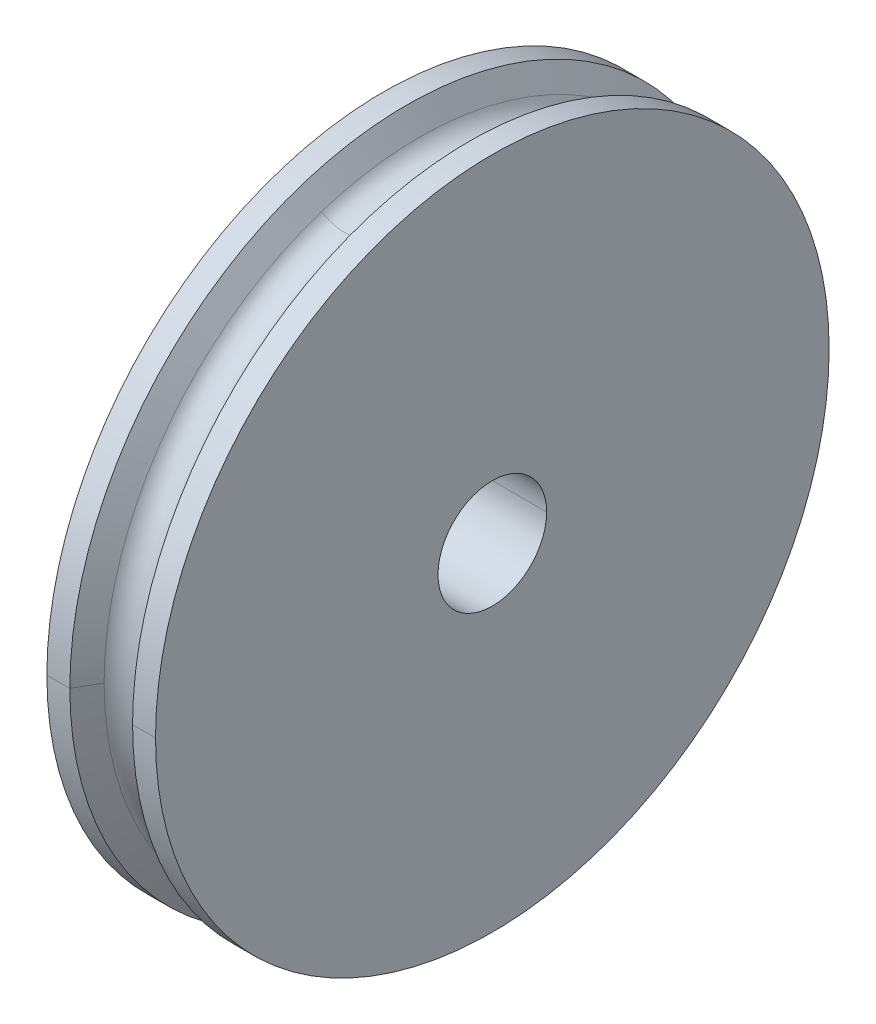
ISO-10303-21;
HEADER;
FILE_DESCRIPTION(('STEP AP214'),'2;1');
FILE_NAME('part.step','',(''),(''),'','','');
FILE_SCHEMA(('AUTOMOTIVE_DESIGN { 1 0 10303 214 1 1 1 1 }'));
ENDSEC;
DATA;
#1=APPLICATION_CONTEXT('core data for automotive mechanical design processes');
#2=APPLICATION_PROTOCOL_DEFINITION('international standard','automotive_design',2000,#1);
#3=PRODUCT_CONTEXT('',#1,'mechanical');
#4=PRODUCT('Part','Part','',(#3));
#5=PRODUCT_RELATED_PRODUCT_CATEGORY('part','',(#4));
#6=PRODUCT_DEFINITION_FORMATION('','',#4);
#7=PRODUCT_DEFINITION_CONTEXT('part definition',#1,'design');
#8=PRODUCT_DEFINITION('design','',#6,#7);
#9=PRODUCT_DEFINITION_SHAPE('','',#8);
#10=(LENGTH_UNIT() NAMED_UNIT(*) SI_UNIT(.MILLI.,.METRE.));
#11=(NAMED_UNIT(*) PLANE_ANGLE_UNIT() SI_UNIT($,.RADIAN.));
#12=(NAMED_UNIT(*) SI_UNIT($,.STERADIAN.) SOLID_ANGLE_UNIT());
#13=UNCERTAINTY_MEASURE_WITH_UNIT(LENGTH_MEASURE(1.E-05),#10,'distance_accuracy_value','');
#14=(GEOMETRIC_REPRESENTATION_CONTEXT(3) GLOBAL_UNCERTAINTY_ASSIGNED_CONTEXT((#13)) GLOBAL_UNIT_ASSIGNED_CONTEXT((#10,
#11,#12)) REPRESENTATION_CONTEXT('',''));
#15=CARTESIAN_POINT('',(0.,0.,0.));
#16=DIRECTION('',(0.,0.,1.));
#17=DIRECTION('',(1.,0.,0.));
#18=AXIS2_PLACEMENT_3D('',#15,#16,#17);
#19=CARTESIAN_POINT('',(-5.,31.,0.));
#20=DIRECTION('',(-1.,0.,0.));
#21=DIRECTION('',(0.,0.,1.));
#22=AXIS2_PLACEMENT_3D('',#19,#20,#21);
#23=PLANE('',#22);
#24=CARTESIAN_POINT('',(-5.,0.,0.));
#25=DIRECTION('',(1.,0.,0.));
#26=DIRECTION('',(0.,0.,-1.));
#27=AXIS2_PLACEMENT_3D('',#24,#25,#26);
#28=CIRCLE('',#27,5.);
#29=CARTESIAN_POINT('',(-5.,0.,-5.));
#30=VERTEX_POINT('',#29);
#31=CARTESIAN_POINT('',(-5.,0.,5.));
#32=VERTEX_POINT('',#31);
#33=EDGE_CURVE('E11',#30,#32,#28,.T.);
#34=ORIENTED_EDGE('',*,*,#33,.T.);
#35=CARTESIAN_POINT('',(-5.,0.,0.));
#36=DIRECTION('',(1.,0.,0.));
#37=DIRECTION('',(0.,0.,-1.));
#38=AXIS2_PLACEMENT_3D('',#35,#36,#37);
#39=CIRCLE('',#38,5.);
#40=EDGE_CURVE('E25',#32,#30,#39,.T.);
#41=ORIENTED_EDGE('',*,*,#40,.T.);
#42=EDGE_LOOP('',(#34,#41));
#43=FACE_BOUND('',#42,.T.);
#44=CARTESIAN_POINT('',(-5.,0.,0.));
#45=DIRECTION('',(1.,0.,0.));
#46=DIRECTION('',(0.,0.,-1.));
#47=AXIS2_PLACEMENT_3D('',#44,#45,#46);
#48=CIRCLE('',#47,31.);
#49=CARTESIAN_POINT('',(-5.,0.,31.));
#50=VERTEX_POINT('',#49);
#51=CARTESIAN_POINT('',(-5.,0.,-31.));
#52=VERTEX_POINT('',#51);
#53=EDGE_CURVE('E219',#50,#52,#48,.T.);
#54=ORIENTED_EDGE('',*,*,#53,.F.);
#55=CARTESIAN_POINT('',(-5.,0.,0.));
#56=DIRECTION('',(1.,0.,0.));
#57=DIRECTION('',(0.,0.,-1.));
#58=AXIS2_PLACEMENT_3D('',#55,#56,#57);
#59=CIRCLE('',#58,31.);
#60=EDGE_CURVE('E214',#52,#50,#59,.T.);
#61=ORIENTED_EDGE('',*,*,#60,.F.);
#62=EDGE_LOOP('',(#54,#61));
#63=FACE_BOUND('',#62,.T.);
#64=ADVANCED_FACE('F17',(#43,#63),#23,.T.);
#65=CARTESIAN_POINT('',(5.,0.,0.));
#66=DIRECTION('',(1.,0.,0.));
#67=DIRECTION('',(0.,-1.,0.));
#68=AXIS2_PLACEMENT_3D('',#65,#66,#67);
#69=CYLINDRICAL_SURFACE('',#68,31.);
#70=DIRECTION('',(1.,0.,0.));
#71=VECTOR('',#70,1.);
#72=CARTESIAN_POINT('',(-5.,0.,31.));
#73=LINE('',#72,#71);
#74=CARTESIAN_POINT('',(-2.8867513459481,0.,31.));
#75=VERTEX_POINT('',#74);
#76=EDGE_CURVE('E210',#50,#75,#73,.T.);
#77=ORIENTED_EDGE('',*,*,#76,.T.);
#78=CARTESIAN_POINT('',(-2.8867513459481,0.,0.));
#79=DIRECTION('',(1.,0.,0.));
#80=DIRECTION('',(0.,0.,-1.));
#81=AXIS2_PLACEMENT_3D('',#78,#79,#80);
#82=CIRCLE('',#81,31.);
#83=CARTESIAN_POINT('',(-2.8867513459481,0.,-31.));
#84=VERTEX_POINT('',#83);
#85=EDGE_CURVE('E205',#84,#75,#82,.T.);
#86=ORIENTED_EDGE('',*,*,#85,.F.);
#87=DIRECTION('',(1.,0.,0.));
#88=VECTOR('',#87,1.);
#89=CARTESIAN_POINT('',(-5.,0.,-31.));
#90=LINE('',#89,#88);
#91=EDGE_CURVE('E200',#52,#84,#90,.T.);
#92=ORIENTED_EDGE('',*,*,#91,.F.);
#93=ORIENTED_EDGE('',*,*,#60,.T.);
#94=EDGE_LOOP('',(#77,#86,#92,#93));
#95=FACE_BOUND('',#94,.T.);
#96=ADVANCED_FACE('F235',(#95),#69,.T.);
#97=CARTESIAN_POINT('',(5.,0.,0.));
#98=DIRECTION('',(1.,0.,0.));
#99=DIRECTION('',(0.,1.,0.));
#100=AXIS2_PLACEMENT_3D('',#97,#98,#99);
#101=CYLINDRICAL_SURFACE('',#100,31.);
#102=ORIENTED_EDGE('',*,*,#76,.F.);
#103=ORIENTED_EDGE('',*,*,#53,.T.);
#104=ORIENTED_EDGE('',*,*,#91,.T.);
#105=CARTESIAN_POINT('',(-2.8867513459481,0.,0.));
#106=DIRECTION('',(1.,0.,0.));
#107=DIRECTION('',(0.,0.,-1.));
#108=AXIS2_PLACEMENT_3D('',#105,#106,#107);
#109=CIRCLE('',#108,31.);
#110=EDGE_CURVE('E195',#75,#84,#109,.T.);
#111=ORIENTED_EDGE('',*,*,#110,.F.);
#112=EDGE_LOOP('',(#102,#103,#104,#111));
#113=FACE_BOUND('',#112,.T.);
#114=ADVANCED_FACE('F230',(#113),#101,.T.);
#115=CARTESIAN_POINT('',(-1.7320508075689,0.,0.));
#116=DIRECTION('',(-1.,0.,0.));
#117=DIRECTION('',(0.,1.,0.));
#118=AXIS2_PLACEMENT_3D('',#115,#116,#117);
#119=CONICAL_SURFACE('',#118,29.,1.04719755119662);
#120=DIRECTION('',(-0.499999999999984,0.,-0.866025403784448));
#121=VECTOR('',#120,1.);
#122=CARTESIAN_POINT('',(-1.7320508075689,0.,-29.));
#123=LINE('',#122,#121);
#124=CARTESIAN_POINT('',(-1.7320508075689,0.,-29.));
#125=VERTEX_POINT('',#124);
#126=EDGE_CURVE('E190',#125,#84,#123,.T.);
#127=ORIENTED_EDGE('',*,*,#126,.F.);
#128=CARTESIAN_POINT('',(-1.7320508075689,0.,0.));
#129=DIRECTION('',(1.,0.,0.));
#130=DIRECTION('',(0.,0.,-1.));
#131=AXIS2_PLACEMENT_3D('',#128,#129,#130);
#132=CIRCLE('',#131,29.);
#133=CARTESIAN_POINT('',(-1.73205080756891,-27.5806389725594,-8.96149283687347));
#134=VERTEX_POINT('',#133);
#135=EDGE_CURVE('E185',#134,#125,#132,.T.);
#136=ORIENTED_EDGE('',*,*,#135,.F.);
#137=CARTESIAN_POINT('',(-1.7320508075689,0.,0.));
#138=DIRECTION('',(1.,0.,0.));
#139=DIRECTION('',(0.,0.,-1.));
#140=AXIS2_PLACEMENT_3D('',#137,#138,#139);
#141=CIRCLE('',#140,29.);
#142=CARTESIAN_POINT('',(-1.7320508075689,0.,29.));
#143=VERTEX_POINT('',#142);
#144=EDGE_CURVE('E180',#143,#134,#141,.T.);
#145=ORIENTED_EDGE('',*,*,#144,.F.);
#146=DIRECTION('',(-0.499999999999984,0.,0.866025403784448));
#147=VECTOR('',#146,1.);
#148=CARTESIAN_POINT('',(-1.7320508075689,0.,29.));
#149=LINE('',#148,#147);
#150=EDGE_CURVE('E175',#143,#75,#149,.T.);
#151=ORIENTED_EDGE('',*,*,#150,.T.);
#152=ORIENTED_EDGE('',*,*,#110,.T.);
#153=EDGE_LOOP('',(#127,#136,#145,#151,#152));
#154=FACE_BOUND('',#153,.T.);
#155=ADVANCED_FACE('F241',(#154),#119,.T.);
#156=CARTESIAN_POINT('',(-1.7320508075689,0.,0.));
#157=DIRECTION('',(-1.,0.,0.));
#158=DIRECTION('',(0.,-1.,0.));
#159=AXIS2_PLACEMENT_3D('',#156,#157,#158);
#160=CONICAL_SURFACE('',#159,29.,1.04719755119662);
#161=ORIENTED_EDGE('',*,*,#126,.T.);
#162=ORIENTED_EDGE('',*,*,#85,.T.);
#163=ORIENTED_EDGE('',*,*,#150,.F.);
#164=CARTESIAN_POINT('',(-1.7320508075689,0.,0.));
#165=DIRECTION('',(1.,0.,0.));
#166=DIRECTION('',(0.,0.,-1.));
#167=AXIS2_PLACEMENT_3D('',#164,#165,#166);
#168=CIRCLE('',#167,29.);
#169=CARTESIAN_POINT('',(-1.73205080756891,27.5806389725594,8.96149283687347));
#170=VERTEX_POINT('',#169);
#171=EDGE_CURVE('E170',#170,#143,#168,.T.);
#172=ORIENTED_EDGE('',*,*,#171,.F.);
#173=CARTESIAN_POINT('',(-1.7320508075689,0.,0.));
#174=DIRECTION('',(1.,0.,0.));
#175=DIRECTION('',(0.,0.,-1.));
#176=AXIS2_PLACEMENT_3D('',#173,#174,#175);
#177=CIRCLE('',#176,29.);
#178=EDGE_CURVE('E165',#125,#170,#177,.T.);
#179=ORIENTED_EDGE('',*,*,#178,.F.);
#180=EDGE_LOOP('',(#161,#162,#163,#172,#179));
#181=FACE_BOUND('',#180,.T.);
#182=ADVANCED_FACE('F238',(#181),#160,.T.);
#183=CARTESIAN_POINT('',(0.,0.,0.));
#184=DIRECTION('',(1.,0.,0.));
#185=DIRECTION('',(0.,-0.309016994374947,0.951056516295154));
#186=AXIS2_PLACEMENT_3D('',#183,#184,#185);
#187=TOROIDAL_SURFACE('',#186,30.,2.00000000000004);
#188=CARTESIAN_POINT('',(0.,-28.5316954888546,-9.27050983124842));
#189=DIRECTION('',(0.,0.309016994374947,-0.951056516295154));
#190=DIRECTION('',(-0.86602540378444,0.475528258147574,0.154508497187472));
#191=AXIS2_PLACEMENT_3D('',#188,#189,#190);
#192=CIRCLE('',#191,2.00000000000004);
#193=CARTESIAN_POINT('',(1.73205080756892,-27.5806389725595,-8.96149283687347));
#194=VERTEX_POINT('',#193);
#195=EDGE_CURVE('E160',#134,#194,#192,.T.);
#196=ORIENTED_EDGE('',*,*,#195,.F.);
#197=ORIENTED_EDGE('',*,*,#135,.T.);
#198=ORIENTED_EDGE('',*,*,#178,.T.);
#199=CARTESIAN_POINT('',(0.,28.5316954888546,9.27050983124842));
#200=DIRECTION('',(0.,-0.309016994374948,0.951056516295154));
#201=DIRECTION('',(-0.866025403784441,-0.475528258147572,-0.154508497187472));
#202=AXIS2_PLACEMENT_3D('',#199,#200,#201);
#203=CIRCLE('',#202,2.00000000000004);
#204=CARTESIAN_POINT('',(1.73205080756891,27.5806389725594,8.96149283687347));
#205=VERTEX_POINT('',#204);
#206=EDGE_CURVE('E156',#170,#205,#203,.T.);
#207=ORIENTED_EDGE('',*,*,#206,.T.);
#208=CARTESIAN_POINT('',(1.7320508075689,0.,0.));
#209=DIRECTION('',(1.,0.,0.));
#210=DIRECTION('',(0.,0.,-1.));
#211=AXIS2_PLACEMENT_3D('',#208,#209,#210);
#212=CIRCLE('',#211,29.);
#213=CARTESIAN_POINT('',(1.7320508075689,0.,-29.));
#214=VERTEX_POINT('',#213);
#215=EDGE_CURVE('E151',#214,#205,#212,.T.);
#216=ORIENTED_EDGE('',*,*,#215,.F.);
#217=CARTESIAN_POINT('',(1.7320508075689,0.,0.));
#218=DIRECTION('',(1.,0.,0.));
#219=DIRECTION('',(0.,0.,-1.));
#220=AXIS2_PLACEMENT_3D('',#217,#218,#219);
#221=CIRCLE('',#220,29.);
#222=EDGE_CURVE('E146',#194,#214,#221,.T.);
#223=ORIENTED_EDGE('',*,*,#222,.F.);
#224=EDGE_LOOP('',(#196,#197,#198,#207,#216,#223));
#225=FACE_BOUND('',#224,.T.);
#226=ADVANCED_FACE('F251',(#225),#187,.F.);
#227=CARTESIAN_POINT('',(2.8867513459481,0.,0.));
#228=DIRECTION('',(1.,0.,0.));
#229=DIRECTION('',(0.,1.,0.));
#230=AXIS2_PLACEMENT_3D('',#227,#228,#229);
#231=CONICAL_SURFACE('',#230,31.,1.04719755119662);
#232=DIRECTION('',(0.499999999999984,0.,0.866025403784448));
#233=VECTOR('',#232,1.);
#234=CARTESIAN_POINT('',(1.7320508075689,0.,29.));
#235=LINE('',#234,#233);
#236=CARTESIAN_POINT('',(1.7320508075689,0.,29.));
#237=VERTEX_POINT('',#236);
#238=CARTESIAN_POINT('',(2.8867513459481,0.,31.));
#239=VERTEX_POINT('',#238);
#240=EDGE_CURVE('E141',#237,#239,#235,.T.);
#241=ORIENTED_EDGE('',*,*,#240,.F.);
#242=CARTESIAN_POINT('',(1.7320508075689,0.,0.));
#243=DIRECTION('',(1.,0.,0.));
#244=DIRECTION('',(0.,0.,-1.));
#245=AXIS2_PLACEMENT_3D('',#242,#243,#244);
#246=CIRCLE('',#245,29.);
#247=EDGE_CURVE('E136',#237,#194,#246,.T.);
#248=ORIENTED_EDGE('',*,*,#247,.T.);
#249=ORIENTED_EDGE('',*,*,#222,.T.);
#250=DIRECTION('',(0.499999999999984,0.,-0.866025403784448));
#251=VECTOR('',#250,1.);
#252=CARTESIAN_POINT('',(1.7320508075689,0.,-29.));
#253=LINE('',#252,#251);
#254=CARTESIAN_POINT('',(2.8867513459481,0.,-31.));
#255=VERTEX_POINT('',#254);
#256=EDGE_CURVE('E132',#214,#255,#253,.T.);
#257=ORIENTED_EDGE('',*,*,#256,.T.);
#258=CARTESIAN_POINT('',(2.8867513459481,0.,0.));
#259=DIRECTION('',(1.,0.,0.));
#260=DIRECTION('',(0.,0.,-1.));
#261=AXIS2_PLACEMENT_3D('',#258,#259,#260);
#262=CIRCLE('',#261,31.);
#263=EDGE_CURVE('E127',#239,#255,#262,.T.);
#264=ORIENTED_EDGE('',*,*,#263,.F.);
#265=EDGE_LOOP('',(#241,#248,#249,#257,#264));
#266=FACE_BOUND('',#265,.T.);
#267=ADVANCED_FACE('F253',(#266),#231,.T.);
#268=CARTESIAN_POINT('',(5.,0.,0.));
#269=DIRECTION('',(1.,0.,0.));
#270=DIRECTION('',(0.,1.,0.));
#271=AXIS2_PLACEMENT_3D('',#268,#269,#270);
#272=CYLINDRICAL_SURFACE('',#271,31.);
#273=DIRECTION('',(1.,0.,0.));
#274=VECTOR('',#273,1.);
#275=CARTESIAN_POINT('',(2.8867513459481,0.,31.));
#276=LINE('',#275,#274);
#277=CARTESIAN_POINT('',(5.,0.,31.));
#278=VERTEX_POINT('',#277);
#279=EDGE_CURVE('E122',#239,#278,#276,.T.);
#280=ORIENTED_EDGE('',*,*,#279,.F.);
#281=ORIENTED_EDGE('',*,*,#263,.T.);
#282=DIRECTION('',(1.,0.,0.));
#283=VECTOR('',#282,1.);
#284=CARTESIAN_POINT('',(2.8867513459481,0.,-31.));
#285=LINE('',#284,#283);
#286=CARTESIAN_POINT('',(5.,0.,-31.));
#287=VERTEX_POINT('',#286);
#288=EDGE_CURVE('E118',#255,#287,#285,.T.);
#289=ORIENTED_EDGE('',*,*,#288,.T.);
#290=CARTESIAN_POINT('',(5.,0.,0.));
#291=DIRECTION('',(1.,0.,0.));
#292=DIRECTION('',(0.,0.,-1.));
#293=AXIS2_PLACEMENT_3D('',#290,#291,#292);
#294=CIRCLE('',#293,31.);
#295=EDGE_CURVE('E107',#278,#287,#294,.T.);
#296=ORIENTED_EDGE('',*,*,#295,.F.);
#297=EDGE_LOOP('',(#280,#281,#289,#296));
#298=FACE_BOUND('',#297,.T.);
#299=ADVANCED_FACE('F276',(#298),#272,.T.);
#300=CARTESIAN_POINT('',(5.,5.,0.));
#301=DIRECTION('',(1.,0.,0.));
#302=DIRECTION('',(0.,0.,-1.));
#303=AXIS2_PLACEMENT_3D('',#300,#301,#302);
#304=PLANE('',#303);
#305=CARTESIAN_POINT('',(5.,0.,0.));
#306=DIRECTION('',(1.,0.,0.));
#307=DIRECTION('',(0.,0.,-1.));
#308=AXIS2_PLACEMENT_3D('',#305,#306,#307);
#309=CIRCLE('',#308,31.);
#310=EDGE_CURVE('E104',#287,#278,#309,.T.);
#311=ORIENTED_EDGE('',*,*,#310,.T.);
#312=ORIENTED_EDGE('',*,*,#295,.T.);
#313=EDGE_LOOP('',(#311,#312));
#314=FACE_BOUND('',#313,.T.);
#315=CARTESIAN_POINT('',(5.,0.,0.));
#316=DIRECTION('',(1.,0.,0.));
#317=DIRECTION('',(0.,0.,-1.));
#318=AXIS2_PLACEMENT_3D('',#315,#316,#317);
#319=CIRCLE('',#318,5.);
#320=CARTESIAN_POINT('',(5.,0.,5.));
#321=VERTEX_POINT('',#320);
#322=CARTESIAN_POINT('',(5.,0.,-5.));
#323=VERTEX_POINT('',#322);
#324=EDGE_CURVE('E91',#321,#323,#319,.T.);
#325=ORIENTED_EDGE('',*,*,#324,.F.);
#326=CARTESIAN_POINT('',(5.,0.,0.));
#327=DIRECTION('',(1.,0.,0.));
#328=DIRECTION('',(0.,0.,-1.));
#329=AXIS2_PLACEMENT_3D('',#326,#327,#328);
#330=CIRCLE('',#329,5.);
#331=EDGE_CURVE('E87',#323,#321,#330,.T.);
#332=ORIENTED_EDGE('',*,*,#331,.F.);
#333=EDGE_LOOP('',(#325,#332));
#334=FACE_BOUND('',#333,.T.);
#335=ADVANCED_FACE('F89',(#314,#334),#304,.T.);
#336=CARTESIAN_POINT('',(5.,0.,0.));
#337=DIRECTION('',(1.,0.,0.));
#338=DIRECTION('',(0.,-1.,0.));
#339=AXIS2_PLACEMENT_3D('',#336,#337,#338);
#340=CYLINDRICAL_SURFACE('',#339,5.);
#341=DIRECTION('',(1.,0.,0.));
#342=VECTOR('',#341,1.);
#343=CARTESIAN_POINT('',(-5.,0.,5.));
#344=LINE('',#343,#342);
#345=EDGE_CURVE('E95',#32,#321,#344,.T.);
#346=ORIENTED_EDGE('',*,*,#345,.F.);
#347=ORIENTED_EDGE('',*,*,#33,.F.);
#348=DIRECTION('',(1.,0.,0.));
#349=VECTOR('',#348,1.);
#350=CARTESIAN_POINT('',(-5.,0.,-5.));
#351=LINE('',#350,#349);
#352=EDGE_CURVE('E98',#30,#323,#351,.T.);
#353=ORIENTED_EDGE('',*,*,#352,.T.);
#354=ORIENTED_EDGE('',*,*,#331,.T.);
#355=EDGE_LOOP('',(#346,#347,#353,#354));
#356=FACE_BOUND('',#355,.T.);
#357=ADVANCED_FACE('F99',(#356),#340,.F.);
#358=CARTESIAN_POINT('',(5.,0.,0.));
#359=DIRECTION('',(1.,0.,0.));
#360=DIRECTION('',(0.,1.,0.));
#361=AXIS2_PLACEMENT_3D('',#358,#359,#360);
#362=CYLINDRICAL_SURFACE('',#361,5.);
#363=ORIENTED_EDGE('',*,*,#345,.T.);
#364=ORIENTED_EDGE('',*,*,#324,.T.);
#365=ORIENTED_EDGE('',*,*,#352,.F.);
#366=ORIENTED_EDGE('',*,*,#40,.F.);
#367=EDGE_LOOP('',(#363,#364,#365,#366));
#368=FACE_BOUND('',#367,.T.);
#369=ADVANCED_FACE('F103',(#368),#362,.F.);
#370=CARTESIAN_POINT('',(5.,0.,0.));
#371=DIRECTION('',(1.,0.,0.));
#372=DIRECTION('',(0.,-1.,0.));
#373=AXIS2_PLACEMENT_3D('',#370,#371,#372);
#374=CYLINDRICAL_SURFACE('',#373,31.);
#375=ORIENTED_EDGE('',*,*,#279,.T.);
#376=ORIENTED_EDGE('',*,*,#310,.F.);
#377=ORIENTED_EDGE('',*,*,#288,.F.);
#378=CARTESIAN_POINT('',(2.8867513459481,0.,0.));
#379=DIRECTION('',(1.,0.,0.));
#380=DIRECTION('',(0.,0.,-1.));
#381=AXIS2_PLACEMENT_3D('',#378,#379,#380);
#382=CIRCLE('',#381,31.);
#383=EDGE_CURVE('E101',#255,#239,#382,.T.);
#384=ORIENTED_EDGE('',*,*,#383,.T.);
#385=EDGE_LOOP('',(#375,#376,#377,#384));
#386=FACE_BOUND('',#385,.T.);
#387=ADVANCED_FACE('F273',(#386),#374,.T.);
#388=CARTESIAN_POINT('',(2.8867513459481,0.,0.));
#389=DIRECTION('',(1.,0.,0.));
#390=DIRECTION('',(0.,-1.,0.));
#391=AXIS2_PLACEMENT_3D('',#388,#389,#390);
#392=CONICAL_SURFACE('',#391,31.,1.04719755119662);
#393=ORIENTED_EDGE('',*,*,#240,.T.);
#394=ORIENTED_EDGE('',*,*,#383,.F.);
#395=ORIENTED_EDGE('',*,*,#256,.F.);
#396=ORIENTED_EDGE('',*,*,#215,.T.);
#397=CARTESIAN_POINT('',(1.7320508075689,0.,0.));
#398=DIRECTION('',(1.,0.,0.));
#399=DIRECTION('',(0.,0.,-1.));
#400=AXIS2_PLACEMENT_3D('',#397,#398,#399);
#401=CIRCLE('',#400,29.);
#402=EDGE_CURVE('E249',#205,#237,#401,.T.);
#403=ORIENTED_EDGE('',*,*,#402,.T.);
#404=EDGE_LOOP('',(#393,#394,#395,#396,#403));
#405=FACE_BOUND('',#404,.T.);
#406=ADVANCED_FACE('F257',(#405),#392,.T.);
#407=CARTESIAN_POINT('',(0.,0.,0.));
#408=DIRECTION('',(1.,0.,0.));
#409=DIRECTION('',(0.,0.309016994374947,-0.951056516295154));
#410=AXIS2_PLACEMENT_3D('',#407,#408,#409);
#411=TOROIDAL_SURFACE('',#410,30.,2.00000000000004);
#412=ORIENTED_EDGE('',*,*,#195,.T.);
#413=ORIENTED_EDGE('',*,*,#247,.F.);
#414=ORIENTED_EDGE('',*,*,#402,.F.);
#415=ORIENTED_EDGE('',*,*,#206,.F.);
#416=ORIENTED_EDGE('',*,*,#171,.T.);
#417=ORIENTED_EDGE('',*,*,#144,.T.);
#418=EDGE_LOOP('',(#412,#413,#414,#415,#416,#417));
#419=FACE_BOUND('',#418,.T.);
#420=ADVANCED_FACE('F245',(#419),#411,.F.);
#421=CLOSED_SHELL('',(#64,#96,#114,#155,#182,#226,#267,#299,#335,#357,#369,#387,#406,#420));
#422=MANIFOLD_SOLID_BREP('B1',#421);
#423=ADVANCED_BREP_SHAPE_REPRESENTATION('',(#18,#422),#14);
#424=SHAPE_DEFINITION_REPRESENTATION(#9,#423);
ENDSEC;
END-ISO-10303-21;
